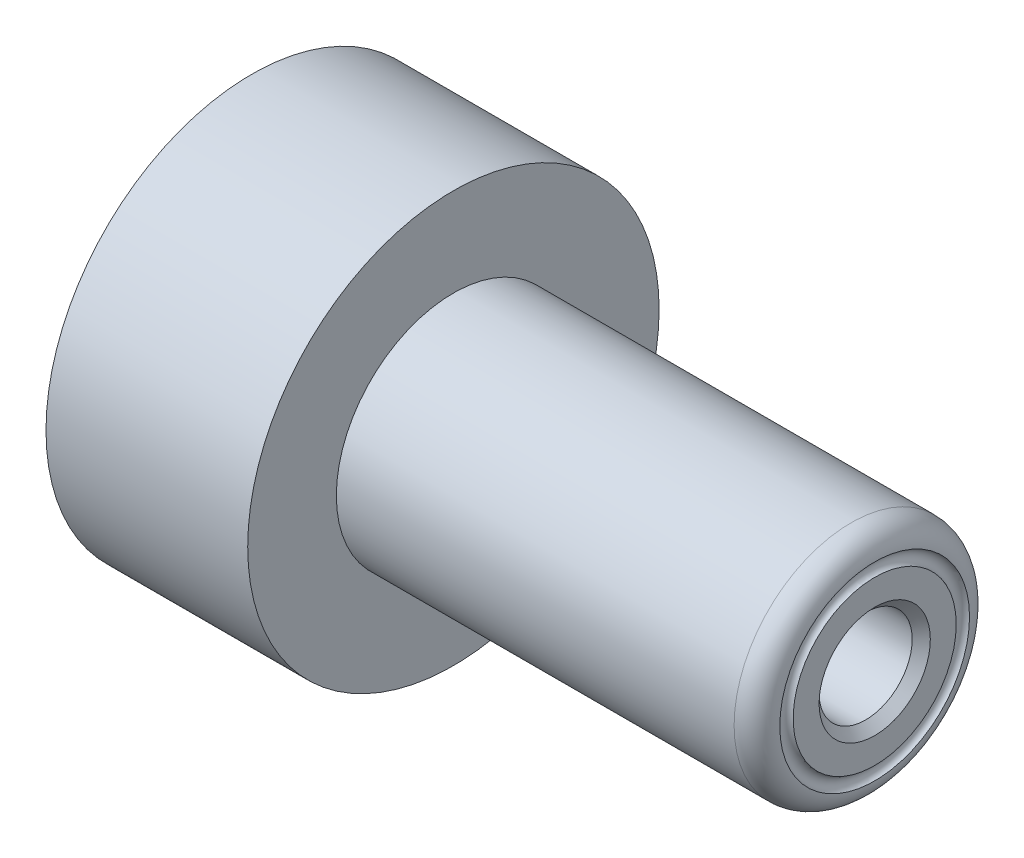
ISO-10303-21;
HEADER;
FILE_DESCRIPTION(('STEP AP214'),'2;1');
FILE_NAME('part.step','',(''),(''),'','','');
FILE_SCHEMA(('AUTOMOTIVE_DESIGN { 1 0 10303 214 1 1 1 1 }'));
ENDSEC;
DATA;
#1=APPLICATION_CONTEXT('core data for automotive mechanical design processes');
#2=APPLICATION_PROTOCOL_DEFINITION('international standard','automotive_design',2000,#1);
#3=PRODUCT_CONTEXT('',#1,'mechanical');
#4=PRODUCT('Part','Part','',(#3));
#5=PRODUCT_RELATED_PRODUCT_CATEGORY('part','',(#4));
#6=PRODUCT_DEFINITION_FORMATION('','',#4);
#7=PRODUCT_DEFINITION_CONTEXT('part definition',#1,'design');
#8=PRODUCT_DEFINITION('design','',#6,#7);
#9=PRODUCT_DEFINITION_SHAPE('','',#8);
#10=(LENGTH_UNIT() NAMED_UNIT(*) SI_UNIT(.MILLI.,.METRE.));
#11=(NAMED_UNIT(*) PLANE_ANGLE_UNIT() SI_UNIT($,.RADIAN.));
#12=(NAMED_UNIT(*) SI_UNIT($,.STERADIAN.) SOLID_ANGLE_UNIT());
#13=UNCERTAINTY_MEASURE_WITH_UNIT(LENGTH_MEASURE(1.E-05),#10,'distance_accuracy_value','');
#14=(GEOMETRIC_REPRESENTATION_CONTEXT(3) GLOBAL_UNCERTAINTY_ASSIGNED_CONTEXT((#13)) GLOBAL_UNIT_ASSIGNED_CONTEXT((#10,
#11,#12)) REPRESENTATION_CONTEXT('',''));
#15=CARTESIAN_POINT('',(0.,0.,0.));
#16=DIRECTION('',(0.,0.,1.));
#17=DIRECTION('',(1.,0.,0.));
#18=AXIS2_PLACEMENT_3D('',#15,#16,#17);
#19=CARTESIAN_POINT('',(33.655,5.0546,0.));
#20=DIRECTION('',(-1.,0.,0.));
#21=DIRECTION('',(0.,0.,1.));
#22=AXIS2_PLACEMENT_3D('',#19,#20,#21);
#23=PLANE('',#22);
#24=CARTESIAN_POINT('',(33.655,0.,0.));
#25=DIRECTION('',(-1.,0.,0.));
#26=DIRECTION('',(0.,0.,1.));
#27=AXIS2_PLACEMENT_3D('',#24,#25,#26);
#28=CIRCLE('',#27,3.00500000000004);
#29=CARTESIAN_POINT('',(33.655,0.,3.00500000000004));
#30=VERTEX_POINT('',#29);
#31=EDGE_CURVE('E10',#30,#30,#28,.T.);
#32=ORIENTED_EDGE('',*,*,#31,.T.);
#33=EDGE_LOOP('',(#32));
#34=FACE_BOUND('',#33,.T.);
#35=CARTESIAN_POINT('',(33.655,0.,0.));
#36=DIRECTION('',(1.,0.,0.));
#37=DIRECTION('',(0.,0.,-1.));
#38=AXIS2_PLACEMENT_3D('',#35,#36,#37);
#39=CIRCLE('',#38,4.40440049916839);
#40=CARTESIAN_POINT('',(33.655,0.,-4.40440049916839));
#41=VERTEX_POINT('',#40);
#42=EDGE_CURVE('E80',#41,#41,#39,.F.);
#43=ORIENTED_EDGE('',*,*,#42,.F.);
#44=EDGE_LOOP('',(#43));
#45=FACE_BOUND('',#44,.T.);
#46=ADVANCED_FACE('F33',(#34,#45),#23,.F.);
#47=CARTESIAN_POINT('',(32.385,0.,0.));
#48=DIRECTION('',(-1.,0.,0.));
#49=DIRECTION('',(0.,0.,1.));
#50=AXIS2_PLACEMENT_3D('',#47,#48,#49);
#51=TOROIDAL_SURFACE('',#50,5.0546,1.27);
#52=CARTESIAN_POINT('',(32.385,0.,0.));
#53=DIRECTION('',(-1.,0.,0.));
#54=DIRECTION('',(0.,0.,1.));
#55=AXIS2_PLACEMENT_3D('',#52,#53,#54);
#56=CIRCLE('',#55,6.3246);
#57=CARTESIAN_POINT('',(32.385,0.,6.3246));
#58=VERTEX_POINT('',#57);
#59=EDGE_CURVE('E50',#58,#58,#56,.T.);
#60=ORIENTED_EDGE('',*,*,#59,.F.);
#61=EDGE_LOOP('',(#60));
#62=FACE_BOUND('',#61,.T.);
#63=CARTESIAN_POINT('',(33.6530512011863,0.,0.));
#64=DIRECTION('',(1.,0.,0.));
#65=DIRECTION('',(0.,0.,-1.));
#66=AXIS2_PLACEMENT_3D('',#63,#64,#65);
#67=CIRCLE('',#66,5.12492887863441);
#68=CARTESIAN_POINT('',(33.6530512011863,0.,-5.12492887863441));
#69=VERTEX_POINT('',#68);
#70=EDGE_CURVE('E37',#69,#69,#67,.T.);
#71=ORIENTED_EDGE('',*,*,#70,.F.);
#72=EDGE_LOOP('',(#71));
#73=FACE_BOUND('',#72,.T.);
#74=ADVANCED_FACE('F89',(#62,#73),#51,.T.);
#75=CARTESIAN_POINT('',(0.,0.,0.));
#76=DIRECTION('',(-1.,0.,0.));
#77=DIRECTION('',(0.,0.,1.));
#78=AXIS2_PLACEMENT_3D('',#75,#76,#77);
#79=CYLINDRICAL_SURFACE('',#78,3.9751);
#80=CARTESIAN_POINT('',(21.8948,0.,0.));
#81=DIRECTION('',(-1.,0.,0.));
#82=DIRECTION('',(0.,0.,1.));
#83=AXIS2_PLACEMENT_3D('',#80,#81,#82);
#84=CIRCLE('',#83,3.9751);
#85=CARTESIAN_POINT('',(21.8948,0.,3.9751));
#86=VERTEX_POINT('',#85);
#87=EDGE_CURVE('E45',#86,#86,#84,.T.);
#88=ORIENTED_EDGE('',*,*,#87,.F.);
#89=EDGE_LOOP('',(#88));
#90=FACE_BOUND('',#89,.T.);
#91=CARTESIAN_POINT('',(0.,0.,0.));
#92=DIRECTION('',(-1.,0.,0.));
#93=DIRECTION('',(0.,0.,1.));
#94=AXIS2_PLACEMENT_3D('',#91,#92,#93);
#95=CIRCLE('',#94,3.9751);
#96=CARTESIAN_POINT('',(0.,0.,3.9751));
#97=VERTEX_POINT('',#96);
#98=EDGE_CURVE('E62',#97,#97,#95,.T.);
#99=ORIENTED_EDGE('',*,*,#98,.T.);
#100=EDGE_LOOP('',(#99));
#101=FACE_BOUND('',#100,.T.);
#102=ADVANCED_FACE('F91',(#90,#101),#79,.F.);
#103=CARTESIAN_POINT('',(21.8948,3.9751,0.));
#104=DIRECTION('',(1.,0.,0.));
#105=DIRECTION('',(0.,0.,-1.));
#106=AXIS2_PLACEMENT_3D('',#103,#104,#105);
#107=PLANE('',#106);
#108=CARTESIAN_POINT('',(21.8948,0.,0.));
#109=DIRECTION('',(1.,0.,0.));
#110=DIRECTION('',(0.,0.,-1.));
#111=AXIS2_PLACEMENT_3D('',#108,#109,#110);
#112=CIRCLE('',#111,2.515);
#113=CARTESIAN_POINT('',(21.8948,0.,-2.515));
#114=VERTEX_POINT('',#113);
#115=EDGE_CURVE('E75',#114,#114,#112,.T.);
#116=ORIENTED_EDGE('',*,*,#115,.T.);
#117=EDGE_LOOP('',(#116));
#118=FACE_BOUND('',#117,.T.);
#119=ORIENTED_EDGE('',*,*,#87,.T.);
#120=EDGE_LOOP('',(#119));
#121=FACE_BOUND('',#120,.T.);
#122=ADVANCED_FACE('F98',(#118,#121),#107,.F.);
#123=CARTESIAN_POINT('',(0.,0.,0.));
#124=DIRECTION('',(-1.,0.,0.));
#125=DIRECTION('',(0.,0.,1.));
#126=AXIS2_PLACEMENT_3D('',#123,#124,#125);
#127=CYLINDRICAL_SURFACE('',#126,6.3246);
#128=CARTESIAN_POINT('',(10.8966,0.,0.));
#129=DIRECTION('',(-1.,0.,0.));
#130=DIRECTION('',(0.,0.,1.));
#131=AXIS2_PLACEMENT_3D('',#128,#129,#130);
#132=CIRCLE('',#131,6.3246);
#133=CARTESIAN_POINT('',(10.8966,0.,6.3246));
#134=VERTEX_POINT('',#133);
#135=EDGE_CURVE('E53',#134,#134,#132,.T.);
#136=ORIENTED_EDGE('',*,*,#135,.F.);
#137=EDGE_LOOP('',(#136));
#138=FACE_BOUND('',#137,.T.);
#139=ORIENTED_EDGE('',*,*,#59,.T.);
#140=EDGE_LOOP('',(#139));
#141=FACE_BOUND('',#140,.T.);
#142=ADVANCED_FACE('F103',(#138,#141),#127,.T.);
#143=CARTESIAN_POINT('',(10.8966,11.1125,0.));
#144=DIRECTION('',(-1.,0.,0.));
#145=DIRECTION('',(0.,0.,1.));
#146=AXIS2_PLACEMENT_3D('',#143,#144,#145);
#147=PLANE('',#146);
#148=CARTESIAN_POINT('',(10.8966,0.,0.));
#149=DIRECTION('',(-1.,0.,0.));
#150=DIRECTION('',(0.,0.,1.));
#151=AXIS2_PLACEMENT_3D('',#148,#149,#150);
#152=CIRCLE('',#151,11.1125);
#153=CARTESIAN_POINT('',(10.8966,0.,11.1125));
#154=VERTEX_POINT('',#153);
#155=EDGE_CURVE('E56',#154,#154,#152,.T.);
#156=ORIENTED_EDGE('',*,*,#155,.F.);
#157=EDGE_LOOP('',(#156));
#158=FACE_BOUND('',#157,.T.);
#159=ORIENTED_EDGE('',*,*,#135,.T.);
#160=EDGE_LOOP('',(#159));
#161=FACE_BOUND('',#160,.T.);
#162=ADVANCED_FACE('F111',(#158,#161),#147,.F.);
#163=CARTESIAN_POINT('',(0.,0.,0.));
#164=DIRECTION('',(-1.,0.,0.));
#165=DIRECTION('',(0.,0.,1.));
#166=AXIS2_PLACEMENT_3D('',#163,#164,#165);
#167=CYLINDRICAL_SURFACE('',#166,11.1125);
#168=CARTESIAN_POINT('',(0.,0.,0.));
#169=DIRECTION('',(-1.,0.,0.));
#170=DIRECTION('',(0.,0.,1.));
#171=AXIS2_PLACEMENT_3D('',#168,#169,#170);
#172=CIRCLE('',#171,11.1125);
#173=CARTESIAN_POINT('',(0.,0.,11.1125));
#174=VERTEX_POINT('',#173);
#175=EDGE_CURVE('E59',#174,#174,#172,.T.);
#176=ORIENTED_EDGE('',*,*,#175,.F.);
#177=EDGE_LOOP('',(#176));
#178=FACE_BOUND('',#177,.T.);
#179=ORIENTED_EDGE('',*,*,#155,.T.);
#180=EDGE_LOOP('',(#179));
#181=FACE_BOUND('',#180,.T.);
#182=ADVANCED_FACE('F123',(#178,#181),#167,.T.);
#183=CARTESIAN_POINT('',(0.,3.9751,0.));
#184=DIRECTION('',(1.,0.,0.));
#185=DIRECTION('',(0.,0.,-1.));
#186=AXIS2_PLACEMENT_3D('',#183,#184,#185);
#187=PLANE('',#186);
#188=CARTESIAN_POINT('',(0.,0.,6.7437));
#189=DIRECTION('',(-1.,0.,0.));
#190=DIRECTION('',(0.,0.,-1.));
#191=AXIS2_PLACEMENT_3D('',#188,#189,#190);
#192=CIRCLE('',#191,1.2065);
#193=CARTESIAN_POINT('',(0.,0.,5.5372));
#194=VERTEX_POINT('',#193);
#195=EDGE_CURVE('E72',#194,#194,#192,.T.);
#196=ORIENTED_EDGE('',*,*,#195,.F.);
#197=EDGE_LOOP('',(#196));
#198=FACE_BOUND('',#197,.T.);
#199=CARTESIAN_POINT('',(0.,0.,-6.7437));
#200=DIRECTION('',(-1.,0.,0.));
#201=DIRECTION('',(0.,0.,1.));
#202=AXIS2_PLACEMENT_3D('',#199,#200,#201);
#203=CIRCLE('',#202,1.2065);
#204=CARTESIAN_POINT('',(0.,0.,-5.5372));
#205=VERTEX_POINT('',#204);
#206=EDGE_CURVE('E66',#205,#205,#203,.T.);
#207=ORIENTED_EDGE('',*,*,#206,.F.);
#208=EDGE_LOOP('',(#207));
#209=FACE_BOUND('',#208,.T.);
#210=ORIENTED_EDGE('',*,*,#98,.F.);
#211=EDGE_LOOP('',(#210));
#212=FACE_BOUND('',#211,.T.);
#213=ORIENTED_EDGE('',*,*,#175,.T.);
#214=EDGE_LOOP('',(#213));
#215=FACE_BOUND('',#214,.T.);
#216=ADVANCED_FACE('F119',(#198,#209,#212,#215),#187,.F.);
#217=CARTESIAN_POINT('',(2.54,0.,-6.7437));
#218=DIRECTION('',(-1.,0.,0.));
#219=DIRECTION('',(0.,0.,1.));
#220=AXIS2_PLACEMENT_3D('',#217,#218,#219);
#221=CYLINDRICAL_SURFACE('',#220,1.2065);
#222=CARTESIAN_POINT('',(2.54,0.,-6.7437));
#223=DIRECTION('',(-1.,0.,0.));
#224=DIRECTION('',(0.,0.,1.));
#225=AXIS2_PLACEMENT_3D('',#222,#223,#224);
#226=CIRCLE('',#225,1.2065);
#227=CARTESIAN_POINT('',(2.54,0.,-5.5372));
#228=VERTEX_POINT('',#227);
#229=EDGE_CURVE('E65',#228,#228,#226,.T.);
#230=ORIENTED_EDGE('',*,*,#229,.F.);
#231=EDGE_LOOP('',(#230));
#232=FACE_BOUND('',#231,.T.);
#233=ORIENTED_EDGE('',*,*,#206,.T.);
#234=EDGE_LOOP('',(#233));
#235=FACE_BOUND('',#234,.T.);
#236=ADVANCED_FACE('F122',(#232,#235),#221,.F.);
#237=CARTESIAN_POINT('',(2.54,0.,-6.7437));
#238=DIRECTION('',(-1.,0.,0.));
#239=DIRECTION('',(0.,0.,1.));
#240=AXIS2_PLACEMENT_3D('',#237,#238,#239);
#241=PLANE('',#240);
#242=ORIENTED_EDGE('',*,*,#229,.T.);
#243=EDGE_LOOP('',(#242));
#244=FACE_BOUND('',#243,.T.);
#245=ADVANCED_FACE('F142',(#244),#241,.T.);
#246=CARTESIAN_POINT('',(2.54,0.,6.7437));
#247=DIRECTION('',(-1.,0.,0.));
#248=DIRECTION('',(0.,0.,1.));
#249=AXIS2_PLACEMENT_3D('',#246,#247,#248);
#250=CYLINDRICAL_SURFACE('',#249,1.2065);
#251=CARTESIAN_POINT('',(2.54,0.,6.7437));
#252=DIRECTION('',(-1.,0.,0.));
#253=DIRECTION('',(0.,0.,-1.));
#254=AXIS2_PLACEMENT_3D('',#251,#252,#253);
#255=CIRCLE('',#254,1.2065);
#256=CARTESIAN_POINT('',(2.54,0.,5.5372));
#257=VERTEX_POINT('',#256);
#258=EDGE_CURVE('E69',#257,#257,#255,.T.);
#259=ORIENTED_EDGE('',*,*,#258,.F.);
#260=EDGE_LOOP('',(#259));
#261=FACE_BOUND('',#260,.T.);
#262=ORIENTED_EDGE('',*,*,#195,.T.);
#263=EDGE_LOOP('',(#262));
#264=FACE_BOUND('',#263,.T.);
#265=ADVANCED_FACE('F146',(#261,#264),#250,.F.);
#266=CARTESIAN_POINT('',(2.54,0.,6.7437));
#267=DIRECTION('',(1.,0.,0.));
#268=DIRECTION('',(0.,0.,-1.));
#269=AXIS2_PLACEMENT_3D('',#266,#267,#268);
#270=PLANE('',#269);
#271=ORIENTED_EDGE('',*,*,#258,.T.);
#272=EDGE_LOOP('',(#271));
#273=FACE_BOUND('',#272,.T.);
#274=ADVANCED_FACE('F150',(#273),#270,.F.);
#275=CARTESIAN_POINT('',(0.,0.,0.));
#276=DIRECTION('',(1.,0.,0.));
#277=DIRECTION('',(0.,0.,-1.));
#278=AXIS2_PLACEMENT_3D('',#275,#276,#277);
#279=CYLINDRICAL_SURFACE('',#278,2.515);
#280=CARTESIAN_POINT('',(33.165,0.,0.));
#281=DIRECTION('',(-1.,0.,0.));
#282=DIRECTION('',(0.,0.,1.));
#283=AXIS2_PLACEMENT_3D('',#280,#281,#282);
#284=CIRCLE('',#283,2.515);
#285=CARTESIAN_POINT('',(33.165,0.,-2.515));
#286=VERTEX_POINT('',#285);
#287=EDGE_CURVE('E41',#286,#286,#284,.F.);
#288=CARTESIAN_POINT('',(33.165,0.,-2.515));
#289=CARTESIAN_POINT('',(33.0476020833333,0.,-2.515));
#290=CARTESIAN_POINT('',(32.9302041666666,0.,-2.515));
#291=CARTESIAN_POINT('',(32.6954083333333,0.,-2.515));
#292=CARTESIAN_POINT('',(32.5780104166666,0.,-2.515));
#293=CARTESIAN_POINT('',(32.3432145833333,0.,-2.515));
#294=CARTESIAN_POINT('',(32.2258166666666,0.,-2.515));
#295=CARTESIAN_POINT('',(31.9910208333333,0.,-2.515));
#296=CARTESIAN_POINT('',(31.8736229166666,0.,-2.515));
#297=CARTESIAN_POINT('',(31.6388270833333,0.,-2.515));
#298=CARTESIAN_POINT('',(31.5214291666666,0.,-2.515));
#299=CARTESIAN_POINT('',(31.2866333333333,0.,-2.515));
#300=CARTESIAN_POINT('',(31.1692354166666,0.,-2.515));
#301=CARTESIAN_POINT('',(30.9344395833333,0.,-2.515));
#302=CARTESIAN_POINT('',(30.8170416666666,0.,-2.515));
#303=CARTESIAN_POINT('',(30.5822458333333,0.,-2.515));
#304=CARTESIAN_POINT('',(30.4648479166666,0.,-2.515));
#305=CARTESIAN_POINT('',(30.2300520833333,0.,-2.515));
#306=CARTESIAN_POINT('',(30.1126541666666,0.,-2.515));
#307=CARTESIAN_POINT('',(29.8778583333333,0.,-2.515));
#308=CARTESIAN_POINT('',(29.7604604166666,0.,-2.515));
#309=CARTESIAN_POINT('',(29.5256645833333,0.,-2.515));
#310=CARTESIAN_POINT('',(29.4082666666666,0.,-2.515));
#311=CARTESIAN_POINT('',(29.1734708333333,0.,-2.515));
#312=CARTESIAN_POINT('',(29.0560729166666,0.,-2.515));
#313=CARTESIAN_POINT('',(28.8212770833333,0.,-2.515));
#314=CARTESIAN_POINT('',(28.7038791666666,0.,-2.515));
#315=CARTESIAN_POINT('',(28.4690833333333,0.,-2.515));
#316=CARTESIAN_POINT('',(28.3516854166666,0.,-2.515));
#317=CARTESIAN_POINT('',(28.1168895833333,0.,-2.515));
#318=CARTESIAN_POINT('',(27.9994916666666,0.,-2.515));
#319=CARTESIAN_POINT('',(27.7646958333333,0.,-2.515));
#320=CARTESIAN_POINT('',(27.6472979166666,0.,-2.515));
#321=CARTESIAN_POINT('',(27.4125020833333,0.,-2.515));
#322=CARTESIAN_POINT('',(27.2951041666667,0.,-2.515));
#323=CARTESIAN_POINT('',(27.0603083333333,0.,-2.515));
#324=CARTESIAN_POINT('',(26.9429104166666,0.,-2.515));
#325=CARTESIAN_POINT('',(26.7081145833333,0.,-2.515));
#326=CARTESIAN_POINT('',(26.5907166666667,0.,-2.515));
#327=CARTESIAN_POINT('',(26.3559208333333,0.,-2.515));
#328=CARTESIAN_POINT('',(26.2385229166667,0.,-2.515));
#329=CARTESIAN_POINT('',(26.0037270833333,0.,-2.515));
#330=CARTESIAN_POINT('',(25.8863291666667,0.,-2.515));
#331=CARTESIAN_POINT('',(25.6515333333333,0.,-2.515));
#332=CARTESIAN_POINT('',(25.5341354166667,0.,-2.515));
#333=CARTESIAN_POINT('',(25.2993395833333,0.,-2.515));
#334=CARTESIAN_POINT('',(25.1819416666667,0.,-2.515));
#335=CARTESIAN_POINT('',(24.9471458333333,0.,-2.515));
#336=CARTESIAN_POINT('',(24.8297479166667,0.,-2.515));
#337=CARTESIAN_POINT('',(24.5949520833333,0.,-2.515));
#338=CARTESIAN_POINT('',(24.4775541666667,0.,-2.515));
#339=CARTESIAN_POINT('',(24.2427583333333,0.,-2.515));
#340=CARTESIAN_POINT('',(24.1253604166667,0.,-2.515));
#341=CARTESIAN_POINT('',(23.8905645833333,0.,-2.515));
#342=CARTESIAN_POINT('',(23.7731666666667,0.,-2.515));
#343=CARTESIAN_POINT('',(23.5383708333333,0.,-2.515));
#344=CARTESIAN_POINT('',(23.4209729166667,0.,-2.515));
#345=CARTESIAN_POINT('',(23.1861770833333,0.,-2.515));
#346=CARTESIAN_POINT('',(23.0687791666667,0.,-2.515));
#347=CARTESIAN_POINT('',(22.8339833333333,0.,-2.515));
#348=CARTESIAN_POINT('',(22.7165854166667,0.,-2.515));
#349=CARTESIAN_POINT('',(22.4817895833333,0.,-2.515));
#350=CARTESIAN_POINT('',(22.3643916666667,0.,-2.515));
#351=CARTESIAN_POINT('',(22.1295958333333,0.,-2.515));
#352=CARTESIAN_POINT('',(22.0121979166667,0.,-2.515));
#353=CARTESIAN_POINT('',(21.8948,0.,-2.515));
#354=B_SPLINE_CURVE_WITH_KNOTS('',3,(#288,#289,#290,#291,#292,#293,#294,#295,#296,#297,#298,
#299,#300,#301,#302,#303,#304,#305,#306,#307,#308,#309,#310,#311,#312,#313,#314,#315,#316,#317,
#318,#319,#320,#321,#322,#323,#324,#325,#326,#327,#328,#329,#330,#331,#332,#333,#334,#335,#336,
#337,#338,#339,#340,#341,#342,#343,#344,#345,#346,#347,#348,#349,#350,#351,#352,#353),
.UNSPECIFIED.,.F.,.F.,(4,2,2,2,2,2,2,2,2,2,2,2,2,2,2,2,2,2,2,2,2,2,2,2,2,2,2,2,2,2,2,2,4),(0.,
0.35219375,0.7043875,1.05658125,1.40877499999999,1.76096874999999,2.11316249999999,
2.46535624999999,2.81754999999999,3.16974374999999,3.52193749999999,3.87413124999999,
4.22632499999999,4.57851874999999,4.93071249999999,5.28290624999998,5.63509999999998,
5.98729374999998,6.33948749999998,6.69168124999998,7.04387499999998,7.39606874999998,
7.74826249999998,8.10045624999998,8.45264999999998,8.80484374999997,9.15703749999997,
9.50923124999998,9.86142499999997,10.21361875,10.5658125,10.91800625,11.2702),.UNSPECIFIED.);
#355=EDGE_CURVE('BSEAM154',#286,#114,#354,.T.);
#356=ORIENTED_EDGE('',*,*,#287,.T.);
#357=ORIENTED_EDGE('',*,*,#115,.F.);
#358=ORIENTED_EDGE('',*,*,#355,.T.);
#359=ORIENTED_EDGE('',*,*,#355,.F.);
#360=EDGE_LOOP('',(#356,#358,#357,#359));
#361=FACE_BOUND('',#360,.T.);
#362=ADVANCED_FACE('F154',(#361),#279,.F.);
#363=CARTESIAN_POINT('',(33.165,0.,0.));
#364=DIRECTION('',(1.,0.,0.));
#365=DIRECTION('',(0.,0.,-1.));
#366=AXIS2_PLACEMENT_3D('',#363,#364,#365);
#367=CONICAL_SURFACE('',#366,2.515,0.785398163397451);
#368=ORIENTED_EDGE('',*,*,#31,.F.);
#369=EDGE_LOOP('',(#368));
#370=FACE_BOUND('',#369,.T.);
#371=ORIENTED_EDGE('',*,*,#287,.F.);
#372=EDGE_LOOP('',(#371));
#373=FACE_BOUND('',#372,.T.);
#374=ADVANCED_FACE('F35',(#370,#373),#367,.F.);
#375=CARTESIAN_POINT('',(33.778,0.,0.));
#376=DIRECTION('',(-1.,0.,0.));
#377=DIRECTION('',(0.,0.,1.));
#378=AXIS2_PLACEMENT_3D('',#375,#376,#377);
#379=TOROIDAL_SURFACE('',#378,4.765,0.381000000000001);
#380=ORIENTED_EDGE('',*,*,#70,.T.);
#381=EDGE_LOOP('',(#380));
#382=FACE_BOUND('',#381,.T.);
#383=ORIENTED_EDGE('',*,*,#42,.T.);
#384=EDGE_LOOP('',(#383));
#385=FACE_BOUND('',#384,.T.);
#386=ADVANCED_FACE('F87',(#382,#385),#379,.F.);
#387=CLOSED_SHELL('',(#46,#74,#102,#122,#142,#162,#182,#216,#236,#245,#265,#274,#362,#374,#386));
#388=MANIFOLD_SOLID_BREP('B2',#387);
#389=ADVANCED_BREP_SHAPE_REPRESENTATION('',(#18,#388),#14);
#390=SHAPE_DEFINITION_REPRESENTATION(#9,#389);
ENDSEC;
END-ISO-10303-21;
